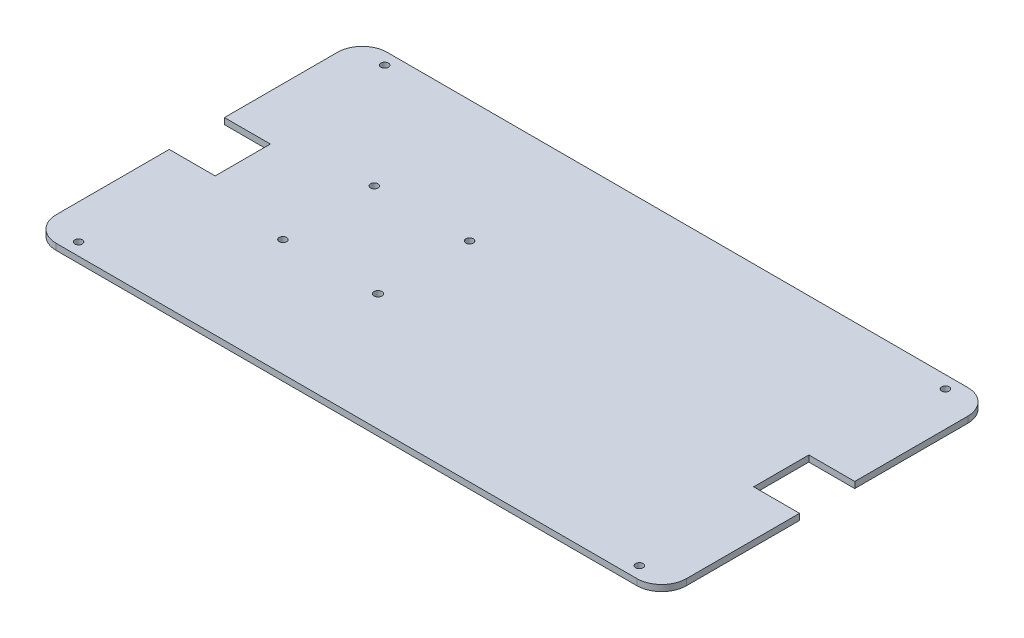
from build123d import *

# Parameters (mm, degrees)
SKETCH1_W               = 254
SKETCH1_H               = 133.35
BOSS_EXTRUDE1_DEPTH     = 2.5
FILLET1_R               = 10
CUT_EXTRUDE4_DEPTH      = 8
CUT_EXTRUDE4_DEPTH_BACK = 4.5
SKETCH2_R               = 1.5
SKETCH3_W               = 18.5
SKETCH3_H               = 22.25
CUT_EXTRUDE5_DEPTH      = 10
SKETCH4_R               = 1.5
SKETCH4_R_2             = 1.6
CUT_EXTRUDE6_DEPTH      = 10


with BuildPart() as part:
    # Sketch1 → Boss-Extrude1 (new body)
    with BuildSketch(Plane(origin=(0, 0, 0), x_dir=(1, 0, 0), z_dir=(0, 1, 0))):
        Rectangle(SKETCH1_W, SKETCH1_H)
    extrude(amount=BOSS_EXTRUDE1_DEPTH)

    # Fillet1
    fillet1_edges = [part.edges().sort_by_distance(p)[0] for p in [
        (127, 1.25, 66.675),
        (-127, 1.25, 66.675),
        (-127, 1.25, -66.675),
        (127, 1.25, -66.675),
    ]]
    fillet(fillet1_edges, radius=FILLET1_R)

    # Sketch2 → Cut-Extrude4 (cut, two sides: drawn at the far end of the back side and taken through both)
    with BuildSketch(Plane(origin=(0, 0, 0), x_dir=(1, 0, 0), z_dir=(0, 1, 0)).offset(-CUT_EXTRUDE4_DEPTH_BACK)):
        with Locations(Location((-113, 61.675, 0), (0, 0, 270))):
            Circle(SKETCH2_R)
        with Locations(Location((-113, -61.675, 0), (0, 0, 270))):
            Circle(SKETCH2_R)
        with Locations(Location((113, 61.675, 0), (0, 0, 270))):
            Circle(SKETCH2_R)
        with Locations(Location((113, -61.675, 0), (0, 0, 270))):
            Circle(SKETCH2_R)
    extrude(amount=CUT_EXTRUDE4_DEPTH + CUT_EXTRUDE4_DEPTH_BACK, mode=Mode.SUBTRACT)

    # Sketch3 → Cut-Extrude5 (cut)
    with BuildSketch(Plane(origin=(0, 2.5, 0), x_dir=(1, 0, 0), z_dir=(0, 1, 0))):
        with Locations((-117.75, 0)):
            Rectangle(SKETCH3_W, SKETCH3_H)
        with Locations((117.75, 0)):
            Rectangle(SKETCH3_W, SKETCH3_H)
    extrude(amount=-CUT_EXTRUDE5_DEPTH, mode=Mode.SUBTRACT)

    # Sketch4 → Cut-Extrude6 (cut)
    with BuildSketch(Plane(origin=(0, 2.5, 0), x_dir=(1, 0, 0), z_dir=(0, 1, 0))):
        with Locations(Location((-72.971138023, 17.47072317, 0), (0, 0, 270))):
            Circle(SKETCH4_R)
        with Locations(Location((-34.565961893, -19.44929638, 0), (0, 0, 270))):
            Circle(SKETCH4_R_2)
        with Locations(Location((-34.54803034, 17.45643569, 0), (0, 0, 270))):
            Circle(SKETCH4_R)
        with Locations(Location((-72.621285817, -19.687797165, 0), (0, 0, 270))):
            Circle(SKETCH4_R)
    extrude(amount=-CUT_EXTRUDE6_DEPTH, mode=Mode.SUBTRACT)


solid = part.part
